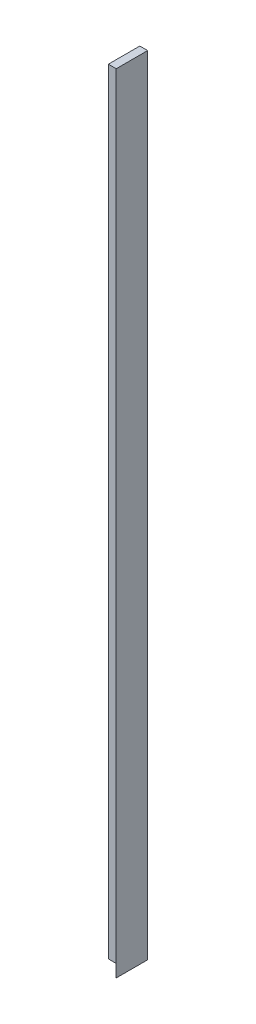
ISO-10303-21;
HEADER;
FILE_DESCRIPTION(('STEP AP214'),'2;1');
FILE_NAME('part.step','',(''),(''),'','','');
FILE_SCHEMA(('AUTOMOTIVE_DESIGN { 1 0 10303 214 1 1 1 1 }'));
ENDSEC;
DATA;
#1=APPLICATION_CONTEXT('core data for automotive mechanical design processes');
#2=APPLICATION_PROTOCOL_DEFINITION('international standard','automotive_design',2000,#1);
#3=PRODUCT_CONTEXT('',#1,'mechanical');
#4=PRODUCT('Part','Part','',(#3));
#5=PRODUCT_RELATED_PRODUCT_CATEGORY('part','',(#4));
#6=PRODUCT_DEFINITION_FORMATION('','',#4);
#7=PRODUCT_DEFINITION_CONTEXT('part definition',#1,'design');
#8=PRODUCT_DEFINITION('design','',#6,#7);
#9=PRODUCT_DEFINITION_SHAPE('','',#8);
#10=(LENGTH_UNIT() NAMED_UNIT(*) SI_UNIT(.MILLI.,.METRE.));
#11=(NAMED_UNIT(*) PLANE_ANGLE_UNIT() SI_UNIT($,.RADIAN.));
#12=(NAMED_UNIT(*) SI_UNIT($,.STERADIAN.) SOLID_ANGLE_UNIT());
#13=UNCERTAINTY_MEASURE_WITH_UNIT(LENGTH_MEASURE(1.E-05),#10,'distance_accuracy_value','');
#14=(GEOMETRIC_REPRESENTATION_CONTEXT(3) GLOBAL_UNCERTAINTY_ASSIGNED_CONTEXT((#13)) GLOBAL_UNIT_ASSIGNED_CONTEXT((#10,
#11,#12)) REPRESENTATION_CONTEXT('',''));
#15=CARTESIAN_POINT('',(0.,0.,0.));
#16=DIRECTION('',(0.,0.,1.));
#17=DIRECTION('',(1.,0.,0.));
#18=AXIS2_PLACEMENT_3D('',#15,#16,#17);
#19=CARTESIAN_POINT('',(6.35,317.5,-12.7));
#20=DIRECTION('',(0.,0.,1.));
#21=DIRECTION('',(0.,-1.,0.));
#22=AXIS2_PLACEMENT_3D('',#19,#20,#21);
#23=PLANE('',#22);
#24=DIRECTION('',(-1.,0.,0.));
#25=VECTOR('',#24,1.);
#26=CARTESIAN_POINT('',(6.35,-317.5,-12.7));
#27=LINE('',#26,#25);
#28=CARTESIAN_POINT('',(6.35,-317.5,-12.7));
#29=VERTEX_POINT('',#28);
#30=CARTESIAN_POINT('',(6.33303067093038,-317.5,-12.7));
#31=VERTEX_POINT('',#30);
#32=EDGE_CURVE('E140',#29,#31,#27,.T.);
#33=ORIENTED_EDGE('',*,*,#32,.T.);
#34=DIRECTION('',(0.,-1.,0.));
#35=VECTOR('',#34,1.);
#36=CARTESIAN_POINT('',(6.33303067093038,-307.34,-12.7));
#37=LINE('',#36,#35);
#38=CARTESIAN_POINT('',(6.33303067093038,-307.34,-12.7));
#39=VERTEX_POINT('',#38);
#40=EDGE_CURVE('E121',#39,#31,#37,.T.);
#41=ORIENTED_EDGE('',*,*,#40,.F.);
#42=DIRECTION('',(1.,0.,0.));
#43=VECTOR('',#42,1.);
#44=CARTESIAN_POINT('',(0.,-307.34,-12.7));
#45=LINE('',#44,#43);
#46=CARTESIAN_POINT('',(0.,-307.34,-12.7));
#47=VERTEX_POINT('',#46);
#48=EDGE_CURVE('E108',#47,#39,#45,.T.);
#49=ORIENTED_EDGE('',*,*,#48,.F.);
#50=DIRECTION('',(0.,1.,0.));
#51=VECTOR('',#50,1.);
#52=CARTESIAN_POINT('',(0.,317.5,-12.7));
#53=LINE('',#52,#51);
#54=CARTESIAN_POINT('',(0.,317.5,-12.7));
#55=VERTEX_POINT('',#54);
#56=EDGE_CURVE('E120',#47,#55,#53,.T.);
#57=ORIENTED_EDGE('',*,*,#56,.T.);
#58=DIRECTION('',(-1.,0.,0.));
#59=VECTOR('',#58,1.);
#60=CARTESIAN_POINT('',(6.35,317.5,-12.7));
#61=LINE('',#60,#59);
#62=CARTESIAN_POINT('',(6.35,317.5,-12.7));
#63=VERTEX_POINT('',#62);
#64=EDGE_CURVE('E11',#63,#55,#61,.T.);
#65=ORIENTED_EDGE('',*,*,#64,.F.);
#66=DIRECTION('',(0.,1.,0.));
#67=VECTOR('',#66,1.);
#68=CARTESIAN_POINT('',(6.35,317.5,-12.7));
#69=LINE('',#68,#67);
#70=EDGE_CURVE('E139',#29,#63,#69,.T.);
#71=ORIENTED_EDGE('',*,*,#70,.F.);
#72=EDGE_LOOP('',(#33,#41,#49,#57,#65,#71));
#73=FACE_BOUND('',#72,.T.);
#74=ADVANCED_FACE('F39',(#73),#23,.F.);
#75=CARTESIAN_POINT('',(6.35,317.5,12.7));
#76=DIRECTION('',(0.,-1.,0.));
#77=DIRECTION('',(0.,0.,-1.));
#78=AXIS2_PLACEMENT_3D('',#75,#76,#77);
#79=PLANE('',#78);
#80=DIRECTION('',(0.,0.,1.));
#81=VECTOR('',#80,1.);
#82=CARTESIAN_POINT('',(0.,317.5,12.7));
#83=LINE('',#82,#81);
#84=CARTESIAN_POINT('',(0.,317.5,12.7));
#85=VERTEX_POINT('',#84);
#86=EDGE_CURVE('E84',#55,#85,#83,.T.);
#87=ORIENTED_EDGE('',*,*,#86,.T.);
#88=DIRECTION('',(-1.,0.,0.));
#89=VECTOR('',#88,1.);
#90=CARTESIAN_POINT('',(6.35,317.5,12.7));
#91=LINE('',#90,#89);
#92=CARTESIAN_POINT('',(6.35,317.5,12.7));
#93=VERTEX_POINT('',#92);
#94=EDGE_CURVE('E46',#93,#85,#91,.T.);
#95=ORIENTED_EDGE('',*,*,#94,.F.);
#96=DIRECTION('',(0.,0.,1.));
#97=VECTOR('',#96,1.);
#98=CARTESIAN_POINT('',(6.35,317.5,12.7));
#99=LINE('',#98,#97);
#100=EDGE_CURVE('E89',#63,#93,#99,.T.);
#101=ORIENTED_EDGE('',*,*,#100,.F.);
#102=ORIENTED_EDGE('',*,*,#64,.T.);
#103=EDGE_LOOP('',(#87,#95,#101,#102));
#104=FACE_BOUND('',#103,.T.);
#105=ADVANCED_FACE('F151',(#104),#79,.F.);
#106=CARTESIAN_POINT('',(6.35,317.5,12.7));
#107=DIRECTION('',(0.,0.,-1.));
#108=DIRECTION('',(0.,1.,0.));
#109=AXIS2_PLACEMENT_3D('',#106,#107,#108);
#110=PLANE('',#109);
#111=DIRECTION('',(-1.,0.,0.));
#112=VECTOR('',#111,1.);
#113=CARTESIAN_POINT('',(0.,-307.34,12.7));
#114=LINE('',#113,#112);
#115=CARTESIAN_POINT('',(6.33303067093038,-307.34,12.7));
#116=VERTEX_POINT('',#115);
#117=CARTESIAN_POINT('',(0.,-307.34,12.7));
#118=VERTEX_POINT('',#117);
#119=EDGE_CURVE('E56',#116,#118,#114,.T.);
#120=ORIENTED_EDGE('',*,*,#119,.F.);
#121=DIRECTION('',(0.,-1.,0.));
#122=VECTOR('',#121,1.);
#123=CARTESIAN_POINT('',(6.33303067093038,-307.34,12.7));
#124=LINE('',#123,#122);
#125=CARTESIAN_POINT('',(6.33303067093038,-317.5,12.7));
#126=VERTEX_POINT('',#125);
#127=EDGE_CURVE('E127',#116,#126,#124,.T.);
#128=ORIENTED_EDGE('',*,*,#127,.T.);
#129=DIRECTION('',(-1.,0.,0.));
#130=VECTOR('',#129,1.);
#131=CARTESIAN_POINT('',(6.35,-317.5,12.7));
#132=LINE('',#131,#130);
#133=CARTESIAN_POINT('',(6.35,-317.5,12.7));
#134=VERTEX_POINT('',#133);
#135=EDGE_CURVE('E143',#134,#126,#132,.T.);
#136=ORIENTED_EDGE('',*,*,#135,.F.);
#137=DIRECTION('',(0.,-1.,0.));
#138=VECTOR('',#137,1.);
#139=CARTESIAN_POINT('',(6.35,317.5,12.7));
#140=LINE('',#139,#138);
#141=EDGE_CURVE('E150',#93,#134,#140,.T.);
#142=ORIENTED_EDGE('',*,*,#141,.F.);
#143=ORIENTED_EDGE('',*,*,#94,.T.);
#144=DIRECTION('',(0.,-1.,0.));
#145=VECTOR('',#144,1.);
#146=CARTESIAN_POINT('',(0.,317.5,12.7));
#147=LINE('',#146,#145);
#148=EDGE_CURVE('E129',#85,#118,#147,.T.);
#149=ORIENTED_EDGE('',*,*,#148,.T.);
#150=EDGE_LOOP('',(#120,#128,#136,#142,#143,#149));
#151=FACE_BOUND('',#150,.T.);
#152=ADVANCED_FACE('F148',(#151),#110,.F.);
#153=CARTESIAN_POINT('',(6.35,-317.5,12.7));
#154=DIRECTION('',(0.,1.,0.));
#155=DIRECTION('',(0.,0.,1.));
#156=AXIS2_PLACEMENT_3D('',#153,#154,#155);
#157=PLANE('',#156);
#158=ORIENTED_EDGE('',*,*,#135,.T.);
#159=DIRECTION('',(0.,0.,1.));
#160=VECTOR('',#159,1.);
#161=CARTESIAN_POINT('',(6.33303067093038,-317.5,-12.7));
#162=LINE('',#161,#160);
#163=EDGE_CURVE('E115',#31,#126,#162,.T.);
#164=ORIENTED_EDGE('',*,*,#163,.F.);
#165=ORIENTED_EDGE('',*,*,#32,.F.);
#166=DIRECTION('',(0.,0.,-1.));
#167=VECTOR('',#166,1.);
#168=CARTESIAN_POINT('',(6.35,-317.5,12.7));
#169=LINE('',#168,#167);
#170=EDGE_CURVE('E68',#134,#29,#169,.T.);
#171=ORIENTED_EDGE('',*,*,#170,.F.);
#172=EDGE_LOOP('',(#158,#164,#165,#171));
#173=FACE_BOUND('',#172,.T.);
#174=ADVANCED_FACE('F158',(#173),#157,.F.);
#175=CARTESIAN_POINT('',(6.35,0.,0.));
#176=DIRECTION('',(1.,0.,0.));
#177=DIRECTION('',(0.,0.,-1.));
#178=AXIS2_PLACEMENT_3D('',#175,#176,#177);
#179=PLANE('',#178);
#180=ORIENTED_EDGE('',*,*,#70,.T.);
#181=ORIENTED_EDGE('',*,*,#100,.T.);
#182=ORIENTED_EDGE('',*,*,#141,.T.);
#183=ORIENTED_EDGE('',*,*,#170,.T.);
#184=EDGE_LOOP('',(#180,#181,#182,#183));
#185=FACE_BOUND('',#184,.T.);
#186=ADVANCED_FACE('F164',(#185),#179,.T.);
#187=CARTESIAN_POINT('',(0.,0.,0.));
#188=DIRECTION('',(1.,0.,0.));
#189=DIRECTION('',(0.,0.,-1.));
#190=AXIS2_PLACEMENT_3D('',#187,#188,#189);
#191=PLANE('',#190);
#192=ORIENTED_EDGE('',*,*,#56,.F.);
#193=DIRECTION('',(0.,0.,-1.));
#194=VECTOR('',#193,1.);
#195=CARTESIAN_POINT('',(0.,-307.34,-12.7));
#196=LINE('',#195,#194);
#197=EDGE_CURVE('E105',#118,#47,#196,.T.);
#198=ORIENTED_EDGE('',*,*,#197,.F.);
#199=ORIENTED_EDGE('',*,*,#148,.F.);
#200=ORIENTED_EDGE('',*,*,#86,.F.);
#201=EDGE_LOOP('',(#192,#198,#199,#200));
#202=FACE_BOUND('',#201,.T.);
#203=ADVANCED_FACE('F125',(#202),#191,.F.);
#204=CARTESIAN_POINT('',(6.33303067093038,-307.34,-12.7));
#205=DIRECTION('',(1.,0.,0.));
#206=DIRECTION('',(0.,0.,-1.));
#207=AXIS2_PLACEMENT_3D('',#204,#205,#206);
#208=PLANE('',#207);
#209=ORIENTED_EDGE('',*,*,#163,.T.);
#210=ORIENTED_EDGE('',*,*,#127,.F.);
#211=DIRECTION('',(0.,0.,1.));
#212=VECTOR('',#211,1.);
#213=CARTESIAN_POINT('',(6.33303067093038,-307.34,-12.7));
#214=LINE('',#213,#212);
#215=EDGE_CURVE('E123',#39,#116,#214,.T.);
#216=ORIENTED_EDGE('',*,*,#215,.F.);
#217=ORIENTED_EDGE('',*,*,#40,.T.);
#218=EDGE_LOOP('',(#209,#210,#216,#217));
#219=FACE_BOUND('',#218,.T.);
#220=ADVANCED_FACE('F168',(#219),#208,.F.);
#221=CARTESIAN_POINT('',(0.,-307.34,0.));
#222=DIRECTION('',(0.,1.,0.));
#223=DIRECTION('',(0.,0.,1.));
#224=AXIS2_PLACEMENT_3D('',#221,#222,#223);
#225=PLANE('',#224);
#226=ORIENTED_EDGE('',*,*,#197,.T.);
#227=ORIENTED_EDGE('',*,*,#48,.T.);
#228=ORIENTED_EDGE('',*,*,#215,.T.);
#229=ORIENTED_EDGE('',*,*,#119,.T.);
#230=EDGE_LOOP('',(#226,#227,#228,#229));
#231=FACE_BOUND('',#230,.T.);
#232=ADVANCED_FACE('F107',(#231),#225,.F.);
#233=CLOSED_SHELL('',(#74,#105,#152,#174,#186,#203,#220,#232));
#234=MANIFOLD_SOLID_BREP('B2',#233);
#235=ADVANCED_BREP_SHAPE_REPRESENTATION('',(#18,#234),#14);
#236=SHAPE_DEFINITION_REPRESENTATION(#9,#235);
ENDSEC;
END-ISO-10303-21;
